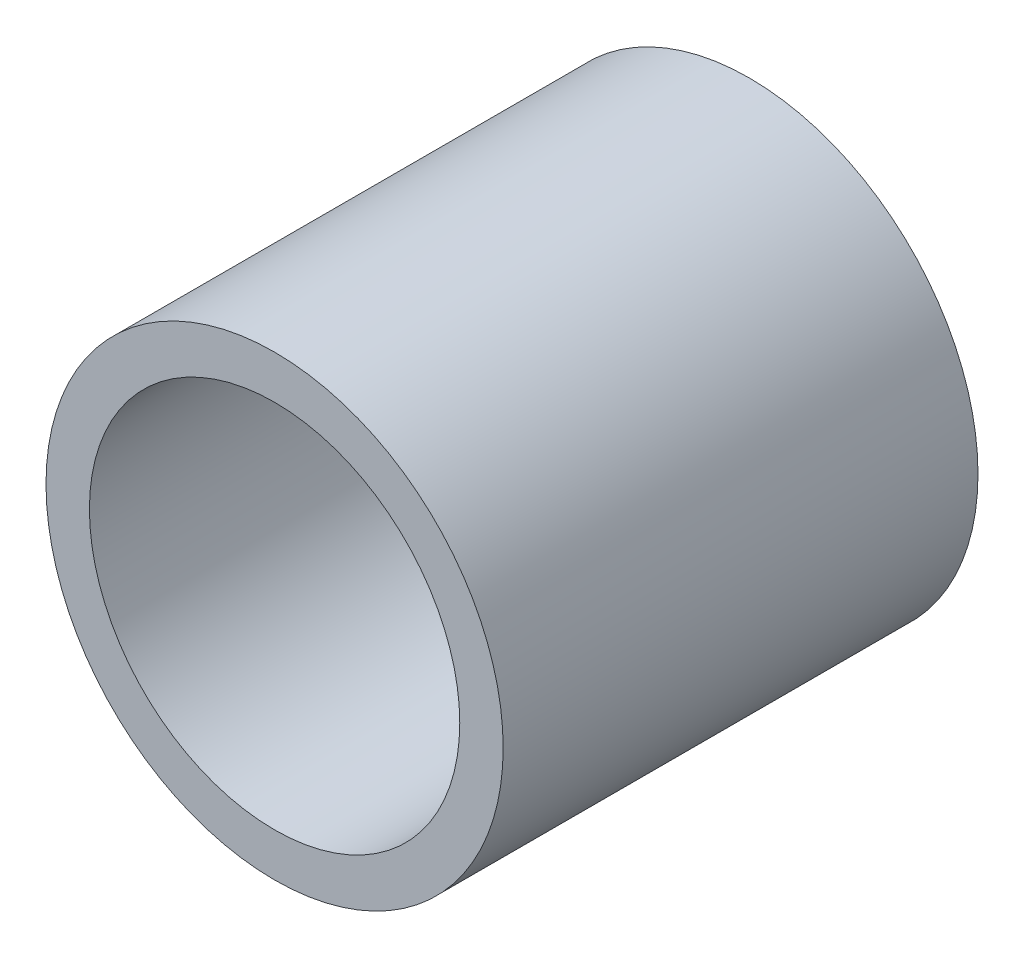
ISO-10303-21;
HEADER;
FILE_DESCRIPTION(('STEP AP214'),'2;1');
FILE_NAME('part.step','',(''),(''),'','','');
FILE_SCHEMA(('AUTOMOTIVE_DESIGN { 1 0 10303 214 1 1 1 1 }'));
ENDSEC;
DATA;
#1=APPLICATION_CONTEXT('core data for automotive mechanical design processes');
#2=APPLICATION_PROTOCOL_DEFINITION('international standard','automotive_design',2000,#1);
#3=PRODUCT_CONTEXT('',#1,'mechanical');
#4=PRODUCT('Part','Part','',(#3));
#5=PRODUCT_RELATED_PRODUCT_CATEGORY('part','',(#4));
#6=PRODUCT_DEFINITION_FORMATION('','',#4);
#7=PRODUCT_DEFINITION_CONTEXT('part definition',#1,'design');
#8=PRODUCT_DEFINITION('design','',#6,#7);
#9=PRODUCT_DEFINITION_SHAPE('','',#8);
#10=(LENGTH_UNIT() NAMED_UNIT(*) SI_UNIT(.MILLI.,.METRE.));
#11=(NAMED_UNIT(*) PLANE_ANGLE_UNIT() SI_UNIT($,.RADIAN.));
#12=(NAMED_UNIT(*) SI_UNIT($,.STERADIAN.) SOLID_ANGLE_UNIT());
#13=UNCERTAINTY_MEASURE_WITH_UNIT(LENGTH_MEASURE(1.E-05),#10,'distance_accuracy_value','');
#14=(GEOMETRIC_REPRESENTATION_CONTEXT(3) GLOBAL_UNCERTAINTY_ASSIGNED_CONTEXT((#13)) GLOBAL_UNIT_ASSIGNED_CONTEXT((#10,
#11,#12)) REPRESENTATION_CONTEXT('',''));
#15=CARTESIAN_POINT('',(0.,0.,0.));
#16=DIRECTION('',(0.,0.,1.));
#17=DIRECTION('',(1.,0.,0.));
#18=AXIS2_PLACEMENT_3D('',#15,#16,#17);
#19=CARTESIAN_POINT('',(0.,0.,17.5));
#20=DIRECTION('',(0.,0.,1.));
#21=DIRECTION('',(1.,0.,0.));
#22=AXIS2_PLACEMENT_3D('',#19,#20,#21);
#23=PLANE('',#22);
#24=CARTESIAN_POINT('',(0.,0.,17.5));
#25=DIRECTION('',(0.,0.,1.));
#26=DIRECTION('',(1.,0.,0.));
#27=AXIS2_PLACEMENT_3D('',#24,#25,#26);
#28=CIRCLE('',#27,16.85);
#29=CARTESIAN_POINT('',(16.85,0.,17.5));
#30=VERTEX_POINT('',#29);
#31=EDGE_CURVE('E10',#30,#30,#28,.T.);
#32=ORIENTED_EDGE('',*,*,#31,.T.);
#33=EDGE_LOOP('',(#32));
#34=FACE_BOUND('',#33,.T.);
#35=CARTESIAN_POINT('',(0.,0.,17.5));
#36=DIRECTION('',(0.,0.,1.));
#37=DIRECTION('',(1.,0.,0.));
#38=AXIS2_PLACEMENT_3D('',#35,#36,#37);
#39=CIRCLE('',#38,13.65);
#40=CARTESIAN_POINT('',(13.65,0.,17.5));
#41=VERTEX_POINT('',#40);
#42=EDGE_CURVE('E41',#41,#41,#39,.T.);
#43=ORIENTED_EDGE('',*,*,#42,.F.);
#44=EDGE_LOOP('',(#43));
#45=FACE_BOUND('',#44,.T.);
#46=ADVANCED_FACE('F30',(#34,#45),#23,.T.);
#47=CARTESIAN_POINT('',(0.,0.,-17.5));
#48=DIRECTION('',(0.,0.,1.));
#49=DIRECTION('',(1.,0.,0.));
#50=AXIS2_PLACEMENT_3D('',#47,#48,#49);
#51=PLANE('',#50);
#52=CARTESIAN_POINT('',(0.,0.,-17.5));
#53=DIRECTION('',(0.,0.,1.));
#54=DIRECTION('',(1.,0.,0.));
#55=AXIS2_PLACEMENT_3D('',#52,#53,#54);
#56=CIRCLE('',#55,16.85);
#57=CARTESIAN_POINT('',(16.85,0.,-17.5));
#58=VERTEX_POINT('',#57);
#59=EDGE_CURVE('E34',#58,#58,#56,.T.);
#60=ORIENTED_EDGE('',*,*,#59,.F.);
#61=EDGE_LOOP('',(#60));
#62=FACE_BOUND('',#61,.T.);
#63=CARTESIAN_POINT('',(0.,0.,-17.5));
#64=DIRECTION('',(0.,0.,1.));
#65=DIRECTION('',(1.,0.,0.));
#66=AXIS2_PLACEMENT_3D('',#63,#64,#65);
#67=CIRCLE('',#66,13.65);
#68=CARTESIAN_POINT('',(13.65,0.,-17.5));
#69=VERTEX_POINT('',#68);
#70=EDGE_CURVE('E43',#69,#69,#67,.T.);
#71=ORIENTED_EDGE('',*,*,#70,.T.);
#72=EDGE_LOOP('',(#71));
#73=FACE_BOUND('',#72,.T.);
#74=ADVANCED_FACE('F53',(#62,#73),#51,.F.);
#75=CARTESIAN_POINT('',(0.,0.,17.5));
#76=DIRECTION('',(0.,0.,-1.));
#77=DIRECTION('',(-1.,0.,0.));
#78=AXIS2_PLACEMENT_3D('',#75,#76,#77);
#79=CYLINDRICAL_SURFACE('',#78,16.85);
#80=ORIENTED_EDGE('',*,*,#31,.F.);
#81=EDGE_LOOP('',(#80));
#82=FACE_BOUND('',#81,.T.);
#83=ORIENTED_EDGE('',*,*,#59,.T.);
#84=EDGE_LOOP('',(#83));
#85=FACE_BOUND('',#84,.T.);
#86=ADVANCED_FACE('F32',(#82,#85),#79,.T.);
#87=CARTESIAN_POINT('',(0.,0.,17.5));
#88=DIRECTION('',(0.,0.,-1.));
#89=DIRECTION('',(-1.,0.,0.));
#90=AXIS2_PLACEMENT_3D('',#87,#88,#89);
#91=CYLINDRICAL_SURFACE('',#90,13.65);
#92=ORIENTED_EDGE('',*,*,#42,.T.);
#93=EDGE_LOOP('',(#92));
#94=FACE_BOUND('',#93,.T.);
#95=ORIENTED_EDGE('',*,*,#70,.F.);
#96=EDGE_LOOP('',(#95));
#97=FACE_BOUND('',#96,.T.);
#98=ADVANCED_FACE('F49',(#94,#97),#91,.F.);
#99=CLOSED_SHELL('',(#46,#74,#86,#98));
#100=MANIFOLD_SOLID_BREP('B2',#99);
#101=ADVANCED_BREP_SHAPE_REPRESENTATION('',(#18,#100),#14);
#102=SHAPE_DEFINITION_REPRESENTATION(#9,#101);
ENDSEC;
END-ISO-10303-21;
